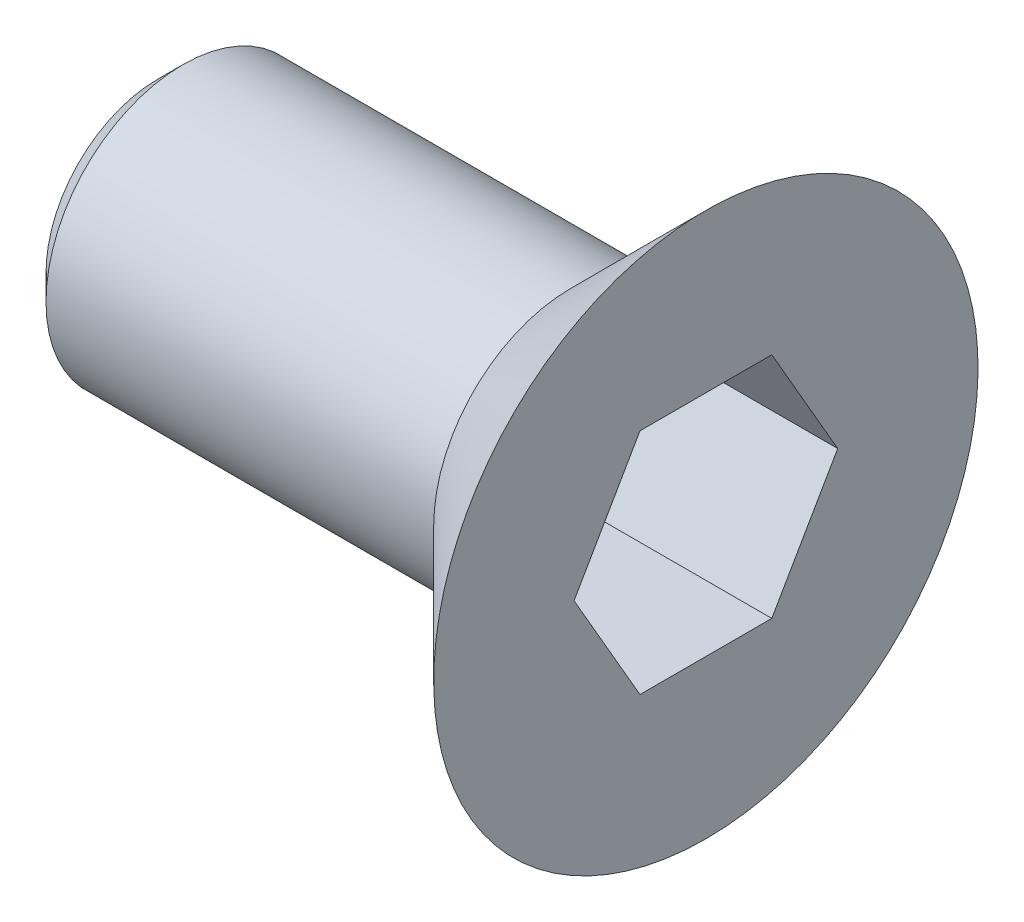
ISO-10303-21;
HEADER;
FILE_DESCRIPTION(('STEP AP214'),'2;1');
FILE_NAME('part.step','',(''),(''),'','','');
FILE_SCHEMA(('AUTOMOTIVE_DESIGN { 1 0 10303 214 1 1 1 1 }'));
ENDSEC;
DATA;
#1=APPLICATION_CONTEXT('core data for automotive mechanical design processes');
#2=APPLICATION_PROTOCOL_DEFINITION('international standard','automotive_design',2000,#1);
#3=PRODUCT_CONTEXT('',#1,'mechanical');
#4=PRODUCT('Part','Part','',(#3));
#5=PRODUCT_RELATED_PRODUCT_CATEGORY('part','',(#4));
#6=PRODUCT_DEFINITION_FORMATION('','',#4);
#7=PRODUCT_DEFINITION_CONTEXT('part definition',#1,'design');
#8=PRODUCT_DEFINITION('design','',#6,#7);
#9=PRODUCT_DEFINITION_SHAPE('','',#8);
#10=(LENGTH_UNIT() NAMED_UNIT(*) SI_UNIT(.MILLI.,.METRE.));
#11=(NAMED_UNIT(*) PLANE_ANGLE_UNIT() SI_UNIT($,.RADIAN.));
#12=(NAMED_UNIT(*) SI_UNIT($,.STERADIAN.) SOLID_ANGLE_UNIT());
#13=UNCERTAINTY_MEASURE_WITH_UNIT(LENGTH_MEASURE(1.E-05),#10,'distance_accuracy_value','');
#14=(GEOMETRIC_REPRESENTATION_CONTEXT(3) GLOBAL_UNCERTAINTY_ASSIGNED_CONTEXT((#13)) GLOBAL_UNIT_ASSIGNED_CONTEXT((#10,
#11,#12)) REPRESENTATION_CONTEXT('',''));
#15=CARTESIAN_POINT('',(0.,0.,0.));
#16=DIRECTION('',(0.,0.,1.));
#17=DIRECTION('',(1.,0.,0.));
#18=AXIS2_PLACEMENT_3D('',#15,#16,#17);
#19=CARTESIAN_POINT('',(-40.5830435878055,0.,0.));
#20=DIRECTION('',(-1.,0.,0.));
#21=DIRECTION('',(0.,-1.,0.));
#22=AXIS2_PLACEMENT_3D('',#19,#20,#21);
#23=CYLINDRICAL_SURFACE('',#22,3.);
#24=CARTESIAN_POINT('',(2.59730158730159,0.,0.));
#25=DIRECTION('',(1.,0.,0.));
#26=DIRECTION('',(0.,1.,0.));
#27=AXIS2_PLACEMENT_3D('',#24,#25,#26);
#28=CIRCLE('',#27,3.);
#29=CARTESIAN_POINT('',(2.59730158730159,3.,0.));
#30=VERTEX_POINT('',#29);
#31=EDGE_CURVE('E11',#30,#30,#28,.T.);
#32=ORIENTED_EDGE('',*,*,#31,.T.);
#33=EDGE_LOOP('',(#32));
#34=FACE_BOUND('',#33,.T.);
#35=CARTESIAN_POINT('',(11.0873015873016,0.,0.));
#36=DIRECTION('',(-1.,0.,0.));
#37=DIRECTION('',(0.,-1.,0.));
#38=AXIS2_PLACEMENT_3D('',#35,#36,#37);
#39=CIRCLE('',#38,3.);
#40=CARTESIAN_POINT('',(11.0873015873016,-3.,0.));
#41=VERTEX_POINT('',#40);
#42=EDGE_CURVE('E137',#41,#41,#39,.T.);
#43=ORIENTED_EDGE('',*,*,#42,.T.);
#44=EDGE_LOOP('',(#43));
#45=FACE_BOUND('',#44,.T.);
#46=ADVANCED_FACE('F26',(#34,#45),#23,.T.);
#47=CARTESIAN_POINT('',(14.0473015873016,0.,0.));
#48=DIRECTION('',(1.,0.,0.));
#49=DIRECTION('',(0.,1.,0.));
#50=AXIS2_PLACEMENT_3D('',#47,#48,#49);
#51=CONICAL_SURFACE('',#50,5.96,0.78539816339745);
#52=ORIENTED_EDGE('',*,*,#42,.F.);
#53=EDGE_LOOP('',(#52));
#54=FACE_BOUND('',#53,.T.);
#55=CARTESIAN_POINT('',(14.0473015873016,0.,0.));
#56=DIRECTION('',(-1.,0.,0.));
#57=DIRECTION('',(0.,-1.,0.));
#58=AXIS2_PLACEMENT_3D('',#55,#56,#57);
#59=CIRCLE('',#58,5.96);
#60=CARTESIAN_POINT('',(14.0473015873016,-5.96,0.));
#61=VERTEX_POINT('',#60);
#62=EDGE_CURVE('E128',#61,#61,#59,.T.);
#63=ORIENTED_EDGE('',*,*,#62,.T.);
#64=EDGE_LOOP('',(#63));
#65=FACE_BOUND('',#64,.T.);
#66=ADVANCED_FACE('F156',(#54,#65),#51,.T.);
#67=CARTESIAN_POINT('',(14.0473015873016,5.96000000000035,0.));
#68=DIRECTION('',(-1.,0.,0.));
#69=DIRECTION('',(0.,-1.,0.));
#70=AXIS2_PLACEMENT_3D('',#67,#68,#69);
#71=PLANE('',#70);
#72=DIRECTION('',(0.,0.866025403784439,0.5));
#73=VECTOR('',#72,1.);
#74=CARTESIAN_POINT('',(14.0473015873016,0.,-2.88675134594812));
#75=LINE('',#74,#73);
#76=CARTESIAN_POINT('',(14.0473015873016,0.,-2.88675134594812));
#77=VERTEX_POINT('',#76);
#78=CARTESIAN_POINT('',(14.0473015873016,2.5,-1.44337567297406));
#79=VERTEX_POINT('',#78);
#80=EDGE_CURVE('E94',#77,#79,#75,.T.);
#81=ORIENTED_EDGE('',*,*,#80,.F.);
#82=DIRECTION('',(0.,0.866025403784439,-0.5));
#83=VECTOR('',#82,1.);
#84=CARTESIAN_POINT('',(14.0473015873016,-2.5,-1.44337567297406));
#85=LINE('',#84,#83);
#86=CARTESIAN_POINT('',(14.0473015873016,-2.5,-1.44337567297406));
#87=VERTEX_POINT('',#86);
#88=EDGE_CURVE('E40',#87,#77,#85,.T.);
#89=ORIENTED_EDGE('',*,*,#88,.F.);
#90=DIRECTION('',(0.,0.,-1.));
#91=VECTOR('',#90,1.);
#92=CARTESIAN_POINT('',(14.0473015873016,-2.5,1.44337567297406));
#93=LINE('',#92,#91);
#94=CARTESIAN_POINT('',(14.0473015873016,-2.5,1.44337567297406));
#95=VERTEX_POINT('',#94);
#96=EDGE_CURVE('E110',#95,#87,#93,.T.);
#97=ORIENTED_EDGE('',*,*,#96,.F.);
#98=DIRECTION('',(0.,-0.866025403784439,-0.5));
#99=VECTOR('',#98,1.);
#100=CARTESIAN_POINT('',(14.0473015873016,0.,2.88675134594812));
#101=LINE('',#100,#99);
#102=CARTESIAN_POINT('',(14.0473015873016,0.,2.88675134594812));
#103=VERTEX_POINT('',#102);
#104=EDGE_CURVE('E104',#103,#95,#101,.T.);
#105=ORIENTED_EDGE('',*,*,#104,.F.);
#106=DIRECTION('',(0.,-0.866025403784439,0.5));
#107=VECTOR('',#106,1.);
#108=CARTESIAN_POINT('',(14.0473015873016,2.5,1.44337567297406));
#109=LINE('',#108,#107);
#110=CARTESIAN_POINT('',(14.0473015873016,2.5,1.44337567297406));
#111=VERTEX_POINT('',#110);
#112=EDGE_CURVE('E102',#111,#103,#109,.T.);
#113=ORIENTED_EDGE('',*,*,#112,.F.);
#114=DIRECTION('',(0.,0.,1.));
#115=VECTOR('',#114,1.);
#116=CARTESIAN_POINT('',(14.0473015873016,2.5,-1.44337567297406));
#117=LINE('',#116,#115);
#118=EDGE_CURVE('E83',#79,#111,#117,.T.);
#119=ORIENTED_EDGE('',*,*,#118,.F.);
#120=EDGE_LOOP('',(#81,#89,#97,#105,#113,#119));
#121=FACE_BOUND('',#120,.T.);
#122=ORIENTED_EDGE('',*,*,#62,.F.);
#123=EDGE_LOOP('',(#122));
#124=FACE_BOUND('',#123,.T.);
#125=ADVANCED_FACE('F98',(#121,#124),#71,.F.);
#126=CARTESIAN_POINT('',(2.04730158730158,0.,0.));
#127=DIRECTION('',(1.,0.,0.));
#128=DIRECTION('',(0.,1.,0.));
#129=AXIS2_PLACEMENT_3D('',#126,#127,#128);
#130=PLANE('',#129);
#131=CARTESIAN_POINT('',(2.04730158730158,0.,0.));
#132=DIRECTION('',(1.,0.,0.));
#133=DIRECTION('',(0.,1.,0.));
#134=AXIS2_PLACEMENT_3D('',#131,#132,#133);
#135=CIRCLE('',#134,2.45);
#136=CARTESIAN_POINT('',(2.04730158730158,2.45,0.));
#137=VERTEX_POINT('',#136);
#138=EDGE_CURVE('E33',#137,#137,#135,.F.);
#139=ORIENTED_EDGE('',*,*,#138,.T.);
#140=EDGE_LOOP('',(#139));
#141=FACE_BOUND('',#140,.T.);
#142=ADVANCED_FACE('F142',(#141),#130,.F.);
#143=CARTESIAN_POINT('',(10.0473015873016,-2.5,-1.44337567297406));
#144=DIRECTION('',(0.,-0.5,-0.866025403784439));
#145=DIRECTION('',(0.,0.866025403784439,-0.5));
#146=AXIS2_PLACEMENT_3D('',#143,#144,#145);
#147=PLANE('',#146);
#148=ORIENTED_EDGE('',*,*,#88,.T.);
#149=DIRECTION('',(1.,0.,0.));
#150=VECTOR('',#149,1.);
#151=CARTESIAN_POINT('',(10.0473015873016,0.,-2.88675134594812));
#152=LINE('',#151,#150);
#153=CARTESIAN_POINT('',(10.0473015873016,0.,-2.88675134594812));
#154=VERTEX_POINT('',#153);
#155=EDGE_CURVE('E91',#154,#77,#152,.T.);
#156=ORIENTED_EDGE('',*,*,#155,.F.);
#157=DIRECTION('',(0.,0.866025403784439,-0.5));
#158=VECTOR('',#157,1.);
#159=CARTESIAN_POINT('',(10.0473015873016,-2.5,-1.44337567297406));
#160=LINE('',#159,#158);
#161=CARTESIAN_POINT('',(10.0473015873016,-2.5,-1.44337567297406));
#162=VERTEX_POINT('',#161);
#163=EDGE_CURVE('E112',#162,#154,#160,.T.);
#164=ORIENTED_EDGE('',*,*,#163,.F.);
#165=DIRECTION('',(1.,0.,0.));
#166=VECTOR('',#165,1.);
#167=CARTESIAN_POINT('',(10.0473015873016,-2.5,-1.44337567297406));
#168=LINE('',#167,#166);
#169=EDGE_CURVE('E47',#162,#87,#168,.T.);
#170=ORIENTED_EDGE('',*,*,#169,.T.);
#171=EDGE_LOOP('',(#148,#156,#164,#170));
#172=FACE_BOUND('',#171,.T.);
#173=ADVANCED_FACE('F171',(#172),#147,.F.);
#174=CARTESIAN_POINT('',(10.0473015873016,-2.5,1.44337567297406));
#175=DIRECTION('',(0.,-1.,0.));
#176=DIRECTION('',(0.,0.,-1.));
#177=AXIS2_PLACEMENT_3D('',#174,#175,#176);
#178=PLANE('',#177);
#179=ORIENTED_EDGE('',*,*,#96,.T.);
#180=ORIENTED_EDGE('',*,*,#169,.F.);
#181=DIRECTION('',(0.,0.,-1.));
#182=VECTOR('',#181,1.);
#183=CARTESIAN_POINT('',(10.0473015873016,-2.5,1.44337567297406));
#184=LINE('',#183,#182);
#185=CARTESIAN_POINT('',(10.0473015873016,-2.5,1.44337567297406));
#186=VERTEX_POINT('',#185);
#187=EDGE_CURVE('E124',#186,#162,#184,.T.);
#188=ORIENTED_EDGE('',*,*,#187,.F.);
#189=DIRECTION('',(1.,0.,0.));
#190=VECTOR('',#189,1.);
#191=CARTESIAN_POINT('',(10.0473015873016,-2.5,1.44337567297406));
#192=LINE('',#191,#190);
#193=EDGE_CURVE('E129',#186,#95,#192,.T.);
#194=ORIENTED_EDGE('',*,*,#193,.T.);
#195=EDGE_LOOP('',(#179,#180,#188,#194));
#196=FACE_BOUND('',#195,.T.);
#197=ADVANCED_FACE('F176',(#196),#178,.F.);
#198=CARTESIAN_POINT('',(10.0473015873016,0.,2.88675134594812));
#199=DIRECTION('',(0.,-0.5,0.866025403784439));
#200=DIRECTION('',(0.,-0.866025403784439,-0.5));
#201=AXIS2_PLACEMENT_3D('',#198,#199,#200);
#202=PLANE('',#201);
#203=ORIENTED_EDGE('',*,*,#104,.T.);
#204=ORIENTED_EDGE('',*,*,#193,.F.);
#205=DIRECTION('',(0.,-0.866025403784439,-0.5));
#206=VECTOR('',#205,1.);
#207=CARTESIAN_POINT('',(10.0473015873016,0.,2.88675134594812));
#208=LINE('',#207,#206);
#209=CARTESIAN_POINT('',(10.0473015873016,0.,2.88675134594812));
#210=VERTEX_POINT('',#209);
#211=EDGE_CURVE('E121',#210,#186,#208,.T.);
#212=ORIENTED_EDGE('',*,*,#211,.F.);
#213=DIRECTION('',(1.,0.,0.));
#214=VECTOR('',#213,1.);
#215=CARTESIAN_POINT('',(10.0473015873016,0.,2.88675134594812));
#216=LINE('',#215,#214);
#217=EDGE_CURVE('E131',#210,#103,#216,.T.);
#218=ORIENTED_EDGE('',*,*,#217,.T.);
#219=EDGE_LOOP('',(#203,#204,#212,#218));
#220=FACE_BOUND('',#219,.T.);
#221=ADVANCED_FACE('F184',(#220),#202,.F.);
#222=CARTESIAN_POINT('',(10.0473015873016,2.5,1.44337567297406));
#223=DIRECTION('',(0.,0.5,0.866025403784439));
#224=DIRECTION('',(0.,-0.866025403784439,0.5));
#225=AXIS2_PLACEMENT_3D('',#222,#223,#224);
#226=PLANE('',#225);
#227=ORIENTED_EDGE('',*,*,#112,.T.);
#228=ORIENTED_EDGE('',*,*,#217,.F.);
#229=DIRECTION('',(0.,-0.866025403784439,0.5));
#230=VECTOR('',#229,1.);
#231=CARTESIAN_POINT('',(10.0473015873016,2.5,1.44337567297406));
#232=LINE('',#231,#230);
#233=CARTESIAN_POINT('',(10.0473015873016,2.5,1.44337567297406));
#234=VERTEX_POINT('',#233);
#235=EDGE_CURVE('E118',#234,#210,#232,.T.);
#236=ORIENTED_EDGE('',*,*,#235,.F.);
#237=DIRECTION('',(1.,0.,0.));
#238=VECTOR('',#237,1.);
#239=CARTESIAN_POINT('',(10.0473015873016,2.5,1.44337567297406));
#240=LINE('',#239,#238);
#241=EDGE_CURVE('E90',#234,#111,#240,.T.);
#242=ORIENTED_EDGE('',*,*,#241,.T.);
#243=EDGE_LOOP('',(#227,#228,#236,#242));
#244=FACE_BOUND('',#243,.T.);
#245=ADVANCED_FACE('F181',(#244),#226,.F.);
#246=CARTESIAN_POINT('',(10.0473015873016,2.5,-1.44337567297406));
#247=DIRECTION('',(0.,1.,0.));
#248=DIRECTION('',(0.,0.,1.));
#249=AXIS2_PLACEMENT_3D('',#246,#247,#248);
#250=PLANE('',#249);
#251=ORIENTED_EDGE('',*,*,#118,.T.);
#252=ORIENTED_EDGE('',*,*,#241,.F.);
#253=DIRECTION('',(0.,0.,1.));
#254=VECTOR('',#253,1.);
#255=CARTESIAN_POINT('',(10.0473015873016,2.5,-1.44337567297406));
#256=LINE('',#255,#254);
#257=CARTESIAN_POINT('',(10.0473015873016,2.5,-1.44337567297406));
#258=VERTEX_POINT('',#257);
#259=EDGE_CURVE('E86',#258,#234,#256,.T.);
#260=ORIENTED_EDGE('',*,*,#259,.F.);
#261=DIRECTION('',(1.,0.,0.));
#262=VECTOR('',#261,1.);
#263=CARTESIAN_POINT('',(10.0473015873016,2.5,-1.44337567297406));
#264=LINE('',#263,#262);
#265=EDGE_CURVE('E79',#258,#79,#264,.T.);
#266=ORIENTED_EDGE('',*,*,#265,.T.);
#267=EDGE_LOOP('',(#251,#252,#260,#266));
#268=FACE_BOUND('',#267,.T.);
#269=ADVANCED_FACE('F81',(#268),#250,.F.);
#270=CARTESIAN_POINT('',(10.0473015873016,0.,-2.88675134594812));
#271=DIRECTION('',(0.,0.5,-0.866025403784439));
#272=DIRECTION('',(0.,0.866025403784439,0.5));
#273=AXIS2_PLACEMENT_3D('',#270,#271,#272);
#274=PLANE('',#273);
#275=ORIENTED_EDGE('',*,*,#80,.T.);
#276=ORIENTED_EDGE('',*,*,#265,.F.);
#277=DIRECTION('',(0.,0.866025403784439,0.5));
#278=VECTOR('',#277,1.);
#279=CARTESIAN_POINT('',(10.0473015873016,0.,-2.88675134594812));
#280=LINE('',#279,#278);
#281=EDGE_CURVE('E115',#154,#258,#280,.T.);
#282=ORIENTED_EDGE('',*,*,#281,.F.);
#283=ORIENTED_EDGE('',*,*,#155,.T.);
#284=EDGE_LOOP('',(#275,#276,#282,#283));
#285=FACE_BOUND('',#284,.T.);
#286=ADVANCED_FACE('F95',(#285),#274,.F.);
#287=CARTESIAN_POINT('',(10.0473015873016,-4.99999999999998,0.));
#288=DIRECTION('',(-1.,0.,0.));
#289=DIRECTION('',(0.,0.,1.));
#290=AXIS2_PLACEMENT_3D('',#287,#288,#289);
#291=PLANE('',#290);
#292=ORIENTED_EDGE('',*,*,#163,.T.);
#293=ORIENTED_EDGE('',*,*,#281,.T.);
#294=ORIENTED_EDGE('',*,*,#259,.T.);
#295=ORIENTED_EDGE('',*,*,#235,.T.);
#296=ORIENTED_EDGE('',*,*,#211,.T.);
#297=ORIENTED_EDGE('',*,*,#187,.T.);
#298=EDGE_LOOP('',(#292,#293,#294,#295,#296,#297));
#299=FACE_BOUND('',#298,.T.);
#300=ADVANCED_FACE('F146',(#299),#291,.F.);
#301=CARTESIAN_POINT('',(2.04730158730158,0.,0.));
#302=DIRECTION('',(1.,0.,0.));
#303=DIRECTION('',(0.,1.,0.));
#304=AXIS2_PLACEMENT_3D('',#301,#302,#303);
#305=CONICAL_SURFACE('',#304,2.45,0.785398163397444);
#306=ORIENTED_EDGE('',*,*,#31,.F.);
#307=EDGE_LOOP('',(#306));
#308=FACE_BOUND('',#307,.T.);
#309=ORIENTED_EDGE('',*,*,#138,.F.);
#310=EDGE_LOOP('',(#309));
#311=FACE_BOUND('',#310,.T.);
#312=ADVANCED_FACE('F144',(#308,#311),#305,.T.);
#313=CLOSED_SHELL('',(#46,#66,#125,#142,#173,#197,#221,#245,#269,#286,#300,#312));
#314=MANIFOLD_SOLID_BREP('B2',#313);
#315=ADVANCED_BREP_SHAPE_REPRESENTATION('',(#18,#314),#14);
#316=SHAPE_DEFINITION_REPRESENTATION(#9,#315);
ENDSEC;
END-ISO-10303-21;
